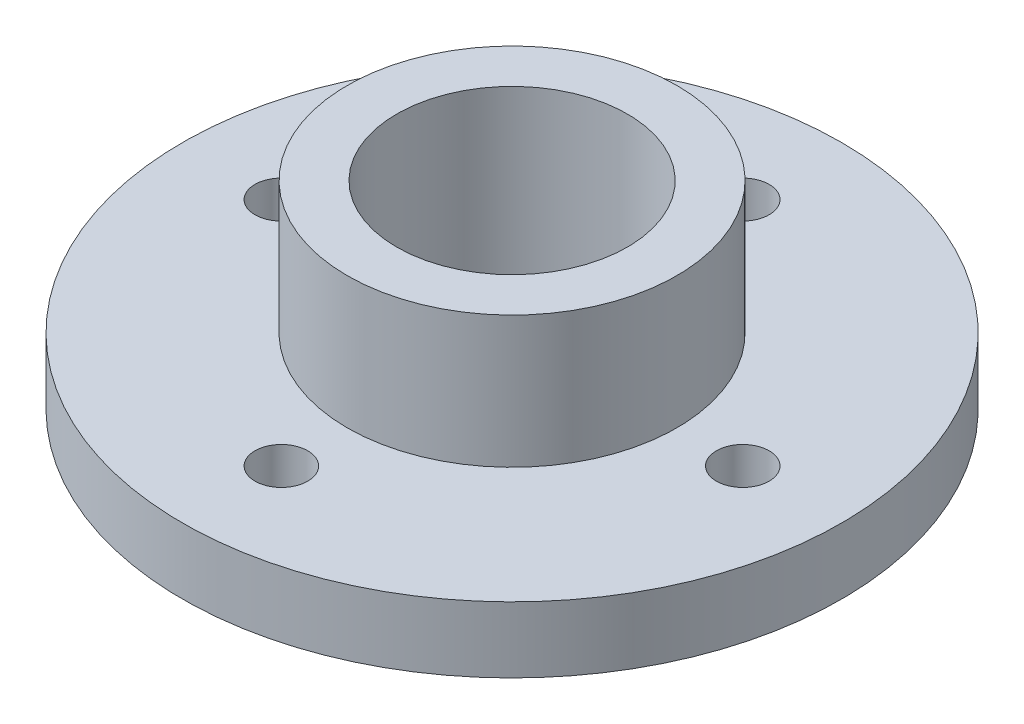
ISO-10303-21;
HEADER;
FILE_DESCRIPTION(('STEP AP214'),'2;1');
FILE_NAME('part.step','',(''),(''),'','','');
FILE_SCHEMA(('AUTOMOTIVE_DESIGN { 1 0 10303 214 1 1 1 1 }'));
ENDSEC;
DATA;
#1=APPLICATION_CONTEXT('core data for automotive mechanical design processes');
#2=APPLICATION_PROTOCOL_DEFINITION('international standard','automotive_design',2000,#1);
#3=PRODUCT_CONTEXT('',#1,'mechanical');
#4=PRODUCT('Part','Part','',(#3));
#5=PRODUCT_RELATED_PRODUCT_CATEGORY('part','',(#4));
#6=PRODUCT_DEFINITION_FORMATION('','',#4);
#7=PRODUCT_DEFINITION_CONTEXT('part definition',#1,'design');
#8=PRODUCT_DEFINITION('design','',#6,#7);
#9=PRODUCT_DEFINITION_SHAPE('','',#8);
#10=(LENGTH_UNIT() NAMED_UNIT(*) SI_UNIT(.MILLI.,.METRE.));
#11=(NAMED_UNIT(*) PLANE_ANGLE_UNIT() SI_UNIT($,.RADIAN.));
#12=(NAMED_UNIT(*) SI_UNIT($,.STERADIAN.) SOLID_ANGLE_UNIT());
#13=UNCERTAINTY_MEASURE_WITH_UNIT(LENGTH_MEASURE(1.E-05),#10,'distance_accuracy_value','');
#14=(GEOMETRIC_REPRESENTATION_CONTEXT(3) GLOBAL_UNCERTAINTY_ASSIGNED_CONTEXT((#13)) GLOBAL_UNIT_ASSIGNED_CONTEXT((#10,
#11,#12)) REPRESENTATION_CONTEXT('',''));
#15=CARTESIAN_POINT('',(0.,0.,0.));
#16=DIRECTION('',(0.,0.,1.));
#17=DIRECTION('',(1.,0.,0.));
#18=AXIS2_PLACEMENT_3D('',#15,#16,#17);
#19=CARTESIAN_POINT('',(3.5,6.,0.));
#20=DIRECTION('',(0.,1.,0.));
#21=DIRECTION('',(0.,0.,1.));
#22=AXIS2_PLACEMENT_3D('',#19,#20,#21);
#23=PLANE('',#22);
#24=CARTESIAN_POINT('',(0.,6.,0.));
#25=DIRECTION('',(0.,1.,0.));
#26=DIRECTION('',(0.,0.,1.));
#27=AXIS2_PLACEMENT_3D('',#24,#25,#26);
#28=CIRCLE('',#27,3.5);
#29=CARTESIAN_POINT('',(0.,6.,3.5));
#30=VERTEX_POINT('',#29);
#31=EDGE_CURVE('E106',#30,#30,#28,.T.);
#32=ORIENTED_EDGE('',*,*,#31,.F.);
#33=EDGE_LOOP('',(#32));
#34=FACE_BOUND('',#33,.T.);
#35=CARTESIAN_POINT('',(0.,6.,0.));
#36=DIRECTION('',(0.,-1.,0.));
#37=DIRECTION('',(0.,0.,-1.));
#38=AXIS2_PLACEMENT_3D('',#35,#36,#37);
#39=CIRCLE('',#38,5.);
#40=CARTESIAN_POINT('',(0.,6.,-5.));
#41=VERTEX_POINT('',#40);
#42=EDGE_CURVE('E10',#41,#41,#39,.T.);
#43=ORIENTED_EDGE('',*,*,#42,.F.);
#44=EDGE_LOOP('',(#43));
#45=FACE_BOUND('',#44,.T.);
#46=ADVANCED_FACE('F41',(#34,#45),#23,.T.);
#47=CARTESIAN_POINT('',(0.,0.,0.));
#48=DIRECTION('',(0.,-1.,0.));
#49=DIRECTION('',(0.,0.,-1.));
#50=AXIS2_PLACEMENT_3D('',#47,#48,#49);
#51=CYLINDRICAL_SURFACE('',#50,5.);
#52=ORIENTED_EDGE('',*,*,#42,.T.);
#53=EDGE_LOOP('',(#52));
#54=FACE_BOUND('',#53,.T.);
#55=CARTESIAN_POINT('',(0.,2.,0.));
#56=DIRECTION('',(0.,-1.,0.));
#57=DIRECTION('',(0.,0.,-1.));
#58=AXIS2_PLACEMENT_3D('',#55,#56,#57);
#59=CIRCLE('',#58,5.);
#60=CARTESIAN_POINT('',(0.,2.,-5.));
#61=VERTEX_POINT('',#60);
#62=EDGE_CURVE('E48',#61,#61,#59,.T.);
#63=ORIENTED_EDGE('',*,*,#62,.F.);
#64=EDGE_LOOP('',(#63));
#65=FACE_BOUND('',#64,.T.);
#66=ADVANCED_FACE('F87',(#54,#65),#51,.T.);
#67=CARTESIAN_POINT('',(5.,2.,0.));
#68=DIRECTION('',(0.,1.,0.));
#69=DIRECTION('',(0.,0.,1.));
#70=AXIS2_PLACEMENT_3D('',#67,#68,#69);
#71=PLANE('',#70);
#72=CARTESIAN_POINT('',(0.,2.,-7.));
#73=DIRECTION('',(0.,1.,0.));
#74=DIRECTION('',(0.,0.,1.));
#75=AXIS2_PLACEMENT_3D('',#72,#73,#74);
#76=CIRCLE('',#75,0.8);
#77=CARTESIAN_POINT('',(0.,2.,-6.2));
#78=VERTEX_POINT('',#77);
#79=EDGE_CURVE('E107',#78,#78,#76,.T.);
#80=ORIENTED_EDGE('',*,*,#79,.F.);
#81=EDGE_LOOP('',(#80));
#82=FACE_BOUND('',#81,.T.);
#83=CARTESIAN_POINT('',(0.,2.,7.));
#84=DIRECTION('',(0.,1.,0.));
#85=DIRECTION('',(0.,0.,1.));
#86=AXIS2_PLACEMENT_3D('',#83,#84,#85);
#87=CIRCLE('',#86,0.8);
#88=CARTESIAN_POINT('',(0.,2.,7.8));
#89=VERTEX_POINT('',#88);
#90=EDGE_CURVE('E74',#89,#89,#87,.T.);
#91=ORIENTED_EDGE('',*,*,#90,.F.);
#92=EDGE_LOOP('',(#91));
#93=FACE_BOUND('',#92,.T.);
#94=CARTESIAN_POINT('',(7.,2.,0.));
#95=DIRECTION('',(0.,1.,0.));
#96=DIRECTION('',(0.,0.,1.));
#97=AXIS2_PLACEMENT_3D('',#94,#95,#96);
#98=CIRCLE('',#97,0.799999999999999);
#99=CARTESIAN_POINT('',(7.,2.,0.799999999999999));
#100=VERTEX_POINT('',#99);
#101=EDGE_CURVE('E62',#100,#100,#98,.T.);
#102=ORIENTED_EDGE('',*,*,#101,.F.);
#103=EDGE_LOOP('',(#102));
#104=FACE_BOUND('',#103,.T.);
#105=CARTESIAN_POINT('',(-7.,2.,0.));
#106=DIRECTION('',(0.,1.,0.));
#107=DIRECTION('',(0.,0.,1.));
#108=AXIS2_PLACEMENT_3D('',#105,#106,#107);
#109=CIRCLE('',#108,0.799999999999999);
#110=CARTESIAN_POINT('',(-7.,2.,0.799999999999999));
#111=VERTEX_POINT('',#110);
#112=EDGE_CURVE('E58',#111,#111,#109,.T.);
#113=ORIENTED_EDGE('',*,*,#112,.F.);
#114=EDGE_LOOP('',(#113));
#115=FACE_BOUND('',#114,.T.);
#116=ORIENTED_EDGE('',*,*,#62,.T.);
#117=EDGE_LOOP('',(#116));
#118=FACE_BOUND('',#117,.T.);
#119=CARTESIAN_POINT('',(0.,2.,0.));
#120=DIRECTION('',(0.,-1.,0.));
#121=DIRECTION('',(0.,0.,-1.));
#122=AXIS2_PLACEMENT_3D('',#119,#120,#121);
#123=CIRCLE('',#122,10.);
#124=CARTESIAN_POINT('',(0.,2.,-10.));
#125=VERTEX_POINT('',#124);
#126=EDGE_CURVE('E52',#125,#125,#123,.T.);
#127=ORIENTED_EDGE('',*,*,#126,.F.);
#128=EDGE_LOOP('',(#127));
#129=FACE_BOUND('',#128,.T.);
#130=ADVANCED_FACE('F81',(#82,#93,#104,#115,#118,#129),#71,.T.);
#131=CARTESIAN_POINT('',(0.,0.,0.));
#132=DIRECTION('',(0.,-1.,0.));
#133=DIRECTION('',(0.,0.,-1.));
#134=AXIS2_PLACEMENT_3D('',#131,#132,#133);
#135=CYLINDRICAL_SURFACE('',#134,10.);
#136=ORIENTED_EDGE('',*,*,#126,.T.);
#137=EDGE_LOOP('',(#136));
#138=FACE_BOUND('',#137,.T.);
#139=CARTESIAN_POINT('',(0.,0.,0.));
#140=DIRECTION('',(0.,-1.,0.));
#141=DIRECTION('',(0.,0.,-1.));
#142=AXIS2_PLACEMENT_3D('',#139,#140,#141);
#143=CIRCLE('',#142,10.);
#144=CARTESIAN_POINT('',(0.,0.,-10.));
#145=VERTEX_POINT('',#144);
#146=EDGE_CURVE('E56',#145,#145,#143,.T.);
#147=ORIENTED_EDGE('',*,*,#146,.F.);
#148=EDGE_LOOP('',(#147));
#149=FACE_BOUND('',#148,.T.);
#150=ADVANCED_FACE('F84',(#138,#149),#135,.T.);
#151=CARTESIAN_POINT('',(0.,0.,0.));
#152=DIRECTION('',(0.,-1.,0.));
#153=DIRECTION('',(0.,0.,-1.));
#154=AXIS2_PLACEMENT_3D('',#151,#152,#153);
#155=PLANE('',#154);
#156=CARTESIAN_POINT('',(0.,0.,0.));
#157=DIRECTION('',(0.,1.,0.));
#158=DIRECTION('',(0.,0.,1.));
#159=AXIS2_PLACEMENT_3D('',#156,#157,#158);
#160=CIRCLE('',#159,3.5);
#161=CARTESIAN_POINT('',(0.,0.,3.5));
#162=VERTEX_POINT('',#161);
#163=EDGE_CURVE('E108',#162,#162,#160,.T.);
#164=ORIENTED_EDGE('',*,*,#163,.T.);
#165=EDGE_LOOP('',(#164));
#166=FACE_BOUND('',#165,.T.);
#167=CARTESIAN_POINT('',(0.,0.,-7.));
#168=DIRECTION('',(0.,-1.,0.));
#169=DIRECTION('',(0.,0.,-1.));
#170=AXIS2_PLACEMENT_3D('',#167,#168,#169);
#171=CIRCLE('',#170,0.799999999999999);
#172=CARTESIAN_POINT('',(0.,0.,-7.8));
#173=VERTEX_POINT('',#172);
#174=EDGE_CURVE('E42',#173,#173,#171,.T.);
#175=ORIENTED_EDGE('',*,*,#174,.F.);
#176=EDGE_LOOP('',(#175));
#177=FACE_BOUND('',#176,.T.);
#178=CARTESIAN_POINT('',(0.,0.,7.));
#179=DIRECTION('',(0.,-1.,0.));
#180=DIRECTION('',(0.,0.,-1.));
#181=AXIS2_PLACEMENT_3D('',#178,#179,#180);
#182=CIRCLE('',#181,0.799999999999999);
#183=CARTESIAN_POINT('',(0.,0.,6.2));
#184=VERTEX_POINT('',#183);
#185=EDGE_CURVE('E70',#184,#184,#182,.T.);
#186=ORIENTED_EDGE('',*,*,#185,.F.);
#187=EDGE_LOOP('',(#186));
#188=FACE_BOUND('',#187,.T.);
#189=CARTESIAN_POINT('',(7.,0.,0.));
#190=DIRECTION('',(0.,-1.,0.));
#191=DIRECTION('',(0.,0.,-1.));
#192=AXIS2_PLACEMENT_3D('',#189,#190,#191);
#193=CIRCLE('',#192,0.799999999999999);
#194=CARTESIAN_POINT('',(7.,0.,-0.799999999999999));
#195=VERTEX_POINT('',#194);
#196=EDGE_CURVE('E63',#195,#195,#193,.T.);
#197=ORIENTED_EDGE('',*,*,#196,.F.);
#198=EDGE_LOOP('',(#197));
#199=FACE_BOUND('',#198,.T.);
#200=CARTESIAN_POINT('',(-7.,0.,0.));
#201=DIRECTION('',(0.,-1.,0.));
#202=DIRECTION('',(0.,0.,-1.));
#203=AXIS2_PLACEMENT_3D('',#200,#201,#202);
#204=CIRCLE('',#203,0.799999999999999);
#205=CARTESIAN_POINT('',(-7.,0.,-0.799999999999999));
#206=VERTEX_POINT('',#205);
#207=EDGE_CURVE('E60',#206,#206,#204,.T.);
#208=ORIENTED_EDGE('',*,*,#207,.F.);
#209=EDGE_LOOP('',(#208));
#210=FACE_BOUND('',#209,.T.);
#211=ORIENTED_EDGE('',*,*,#146,.T.);
#212=EDGE_LOOP('',(#211));
#213=FACE_BOUND('',#212,.T.);
#214=ADVANCED_FACE('F94',(#166,#177,#188,#199,#210,#213),#155,.T.);
#215=CARTESIAN_POINT('',(-7.,2.,0.));
#216=DIRECTION('',(0.,1.,0.));
#217=DIRECTION('',(0.,0.,1.));
#218=AXIS2_PLACEMENT_3D('',#215,#216,#217);
#219=CYLINDRICAL_SURFACE('',#218,0.799999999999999);
#220=ORIENTED_EDGE('',*,*,#207,.T.);
#221=EDGE_LOOP('',(#220));
#222=FACE_BOUND('',#221,.T.);
#223=ORIENTED_EDGE('',*,*,#112,.T.);
#224=EDGE_LOOP('',(#223));
#225=FACE_BOUND('',#224,.T.);
#226=ADVANCED_FACE('F127',(#222,#225),#219,.F.);
#227=CARTESIAN_POINT('',(7.,2.,0.));
#228=DIRECTION('',(0.,1.,0.));
#229=DIRECTION('',(0.,0.,1.));
#230=AXIS2_PLACEMENT_3D('',#227,#228,#229);
#231=CYLINDRICAL_SURFACE('',#230,0.799999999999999);
#232=ORIENTED_EDGE('',*,*,#196,.T.);
#233=EDGE_LOOP('',(#232));
#234=FACE_BOUND('',#233,.T.);
#235=ORIENTED_EDGE('',*,*,#101,.T.);
#236=EDGE_LOOP('',(#235));
#237=FACE_BOUND('',#236,.T.);
#238=ADVANCED_FACE('F137',(#234,#237),#231,.F.);
#239=CARTESIAN_POINT('',(0.,2.,7.));
#240=DIRECTION('',(0.,1.,0.));
#241=DIRECTION('',(0.,0.,1.));
#242=AXIS2_PLACEMENT_3D('',#239,#240,#241);
#243=CYLINDRICAL_SURFACE('',#242,0.799999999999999);
#244=ORIENTED_EDGE('',*,*,#185,.T.);
#245=EDGE_LOOP('',(#244));
#246=FACE_BOUND('',#245,.T.);
#247=ORIENTED_EDGE('',*,*,#90,.T.);
#248=EDGE_LOOP('',(#247));
#249=FACE_BOUND('',#248,.T.);
#250=ADVANCED_FACE('F150',(#246,#249),#243,.F.);
#251=CARTESIAN_POINT('',(0.,2.,-7.));
#252=DIRECTION('',(0.,1.,0.));
#253=DIRECTION('',(0.,0.,1.));
#254=AXIS2_PLACEMENT_3D('',#251,#252,#253);
#255=CYLINDRICAL_SURFACE('',#254,0.799999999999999);
#256=ORIENTED_EDGE('',*,*,#174,.T.);
#257=EDGE_LOOP('',(#256));
#258=FACE_BOUND('',#257,.T.);
#259=ORIENTED_EDGE('',*,*,#79,.T.);
#260=EDGE_LOOP('',(#259));
#261=FACE_BOUND('',#260,.T.);
#262=ADVANCED_FACE('F123',(#258,#261),#255,.F.);
#263=CARTESIAN_POINT('',(0.,0.,0.));
#264=DIRECTION('',(0.,1.,0.));
#265=DIRECTION('',(0.,0.,1.));
#266=AXIS2_PLACEMENT_3D('',#263,#264,#265);
#267=CYLINDRICAL_SURFACE('',#266,3.5);
#268=ORIENTED_EDGE('',*,*,#31,.T.);
#269=EDGE_LOOP('',(#268));
#270=FACE_BOUND('',#269,.T.);
#271=ORIENTED_EDGE('',*,*,#163,.F.);
#272=EDGE_LOOP('',(#271));
#273=FACE_BOUND('',#272,.T.);
#274=ADVANCED_FACE('F154',(#270,#273),#267,.F.);
#275=CLOSED_SHELL('',(#46,#66,#130,#150,#214,#226,#238,#250,#262,#274));
#276=MANIFOLD_SOLID_BREP('B2',#275);
#277=ADVANCED_BREP_SHAPE_REPRESENTATION('',(#18,#276),#14);
#278=SHAPE_DEFINITION_REPRESENTATION(#9,#277);
ENDSEC;
END-ISO-10303-21;
